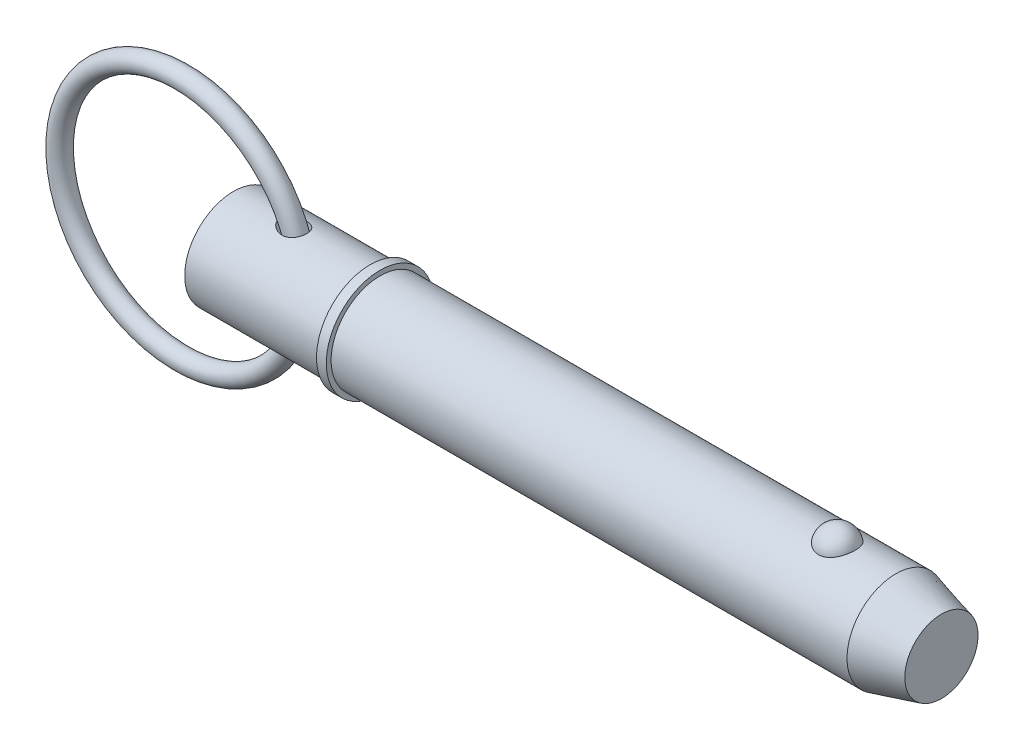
ISO-10303-21;
HEADER;
FILE_DESCRIPTION(('STEP AP214'),'2;1');
FILE_NAME('part.step','',(''),(''),'','','');
FILE_SCHEMA(('AUTOMOTIVE_DESIGN { 1 0 10303 214 1 1 1 1 }'));
ENDSEC;
DATA;
#1=APPLICATION_CONTEXT('core data for automotive mechanical design processes');
#2=APPLICATION_PROTOCOL_DEFINITION('international standard','automotive_design',2000,#1);
#3=PRODUCT_CONTEXT('',#1,'mechanical');
#4=PRODUCT('Part','Part','',(#3));
#5=PRODUCT_RELATED_PRODUCT_CATEGORY('part','',(#4));
#6=PRODUCT_DEFINITION_FORMATION('','',#4);
#7=PRODUCT_DEFINITION_CONTEXT('part definition',#1,'design');
#8=PRODUCT_DEFINITION('design','',#6,#7);
#9=PRODUCT_DEFINITION_SHAPE('','',#8);
#10=(LENGTH_UNIT() NAMED_UNIT(*) SI_UNIT(.MILLI.,.METRE.));
#11=(NAMED_UNIT(*) PLANE_ANGLE_UNIT() SI_UNIT($,.RADIAN.));
#12=(NAMED_UNIT(*) SI_UNIT($,.STERADIAN.) SOLID_ANGLE_UNIT());
#13=UNCERTAINTY_MEASURE_WITH_UNIT(LENGTH_MEASURE(1.E-05),#10,'distance_accuracy_value','');
#14=(GEOMETRIC_REPRESENTATION_CONTEXT(3) GLOBAL_UNCERTAINTY_ASSIGNED_CONTEXT((#13)) GLOBAL_UNIT_ASSIGNED_CONTEXT((#10,
#11,#12)) REPRESENTATION_CONTEXT('',''));
#15=CARTESIAN_POINT('',(0.,0.,0.));
#16=DIRECTION('',(0.,0.,1.));
#17=DIRECTION('',(1.,0.,0.));
#18=AXIS2_PLACEMENT_3D('',#15,#16,#17);
#19=CARTESIAN_POINT('',(-13.4840686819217,0.,0.));
#20=DIRECTION('',(0.,0.,1.));
#21=DIRECTION('',(1.,0.,0.));
#22=AXIS2_PLACEMENT_3D('',#19,#20,#21);
#23=TOROIDAL_SURFACE('',#22,31.75,2.54);
#24=CARTESIAN_POINT('',(20.8059313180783,0.,0.));
#25=VERTEX_POINT('',#24);
#26=VERTEX_LOOP('',#25);
#27=FACE_BOUND('',#26,.T.);
#28=ADVANCED_FACE('P0_F12',(#27),#23,.T.);
#29=CLOSED_SHELL('',(#28));
#30=MANIFOLD_SOLID_BREP('P0_B1',#29);
#31=CARTESIAN_POINT('',(0.,0.,0.));
#32=DIRECTION('',(1.,0.,0.));
#33=DIRECTION('',(0.,0.,-1.));
#34=AXIS2_PLACEMENT_3D('',#31,#32,#33);
#35=CYLINDRICAL_SURFACE('',#34,12.7);
#36=CARTESIAN_POINT('',(13.092900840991,12.5230976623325,-2.11234992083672));
#37=CARTESIAN_POINT('',(13.2535855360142,12.4976398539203,-2.26328363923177));
#38=CARTESIAN_POINT('',(13.4280602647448,12.4718592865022,-2.39955782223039));
#39=CARTESIAN_POINT('',(13.7976341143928,12.4229301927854,-2.64122157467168));
#40=CARTESIAN_POINT('',(13.9927568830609,12.3997847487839,-2.7465751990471));
#41=CARTESIAN_POINT('',(14.397672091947,12.3590534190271,-2.92439761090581));
#42=CARTESIAN_POINT('',(14.6074445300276,12.3414601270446,-2.99691026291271));
#43=CARTESIAN_POINT('',(15.0366557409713,12.3142893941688,-3.10669649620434));
#44=CARTESIAN_POINT('',(15.2560902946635,12.3047084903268,-3.14398530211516));
#45=CARTESIAN_POINT('',(15.5877843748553,12.2976819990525,-3.17128282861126));
#46=CARTESIAN_POINT('',(15.6989364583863,12.2965677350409,-3.17559470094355));
#47=CARTESIAN_POINT('',(15.9211629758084,12.2969101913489,-3.17427486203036));
#48=CARTESIAN_POINT('',(16.0322374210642,12.2983656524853,-3.16864802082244));
#49=CARTESIAN_POINT('',(16.2532861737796,12.3038832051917,-3.14715368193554));
#50=CARTESIAN_POINT('',(16.363260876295,12.3079443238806,-3.13129000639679));
#51=CARTESIAN_POINT('',(16.5810669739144,12.3185954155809,-3.08912320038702));
#52=CARTESIAN_POINT('',(16.6888986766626,12.3251850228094,-3.06282157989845));
#53=CARTESIAN_POINT('',(16.8894247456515,12.3398294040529,-3.00323791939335));
#54=CARTESIAN_POINT('',(16.9824664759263,12.3476389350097,-2.97106098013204));
#55=CARTESIAN_POINT('',(17.1651267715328,12.3648759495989,-2.89848824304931));
#56=CARTESIAN_POINT('',(17.2547457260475,12.3743032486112,-2.85809338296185));
#57=CARTESIAN_POINT('',(17.4297224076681,12.3944822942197,-2.76927391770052));
#58=CARTESIAN_POINT('',(17.5150817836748,12.40523352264,-2.72085245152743));
#59=CARTESIAN_POINT('',(17.6807665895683,12.4277046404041,-2.61629867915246));
#60=CARTESIAN_POINT('',(17.7610923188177,12.4394244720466,-2.56016683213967));
#61=CARTESIAN_POINT('',(17.9797287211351,12.4733252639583,-2.39133767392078));
#62=CARTESIAN_POINT('',(18.1114611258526,12.4961902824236,-2.27005507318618));
#63=CARTESIAN_POINT('',(18.3518677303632,12.5412050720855,-2.00648954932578));
#64=CARTESIAN_POINT('',(18.4605454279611,12.5633549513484,-1.86420981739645));
#65=CARTESIAN_POINT('',(18.6498843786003,12.6039384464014,-1.5661481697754));
#66=CARTESIAN_POINT('',(18.7311185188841,12.622444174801,-1.41073996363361));
#67=CARTESIAN_POINT('',(18.8669149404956,12.6543302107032,-1.08819514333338));
#68=CARTESIAN_POINT('',(18.921477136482,12.6677105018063,-0.921058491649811));
#69=CARTESIAN_POINT('',(19.0028875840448,12.6879542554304,-0.57902988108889));
#70=CARTESIAN_POINT('',(19.0296164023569,12.6947896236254,-0.40410783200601));
#71=CARTESIAN_POINT('',(19.0543673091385,12.7011128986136,-0.0521104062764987));
#72=CARTESIAN_POINT('',(19.0523885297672,12.7006005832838,0.124965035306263));
#73=CARTESIAN_POINT('',(19.019700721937,12.692266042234,0.476969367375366));
#74=CARTESIAN_POINT('',(18.9888798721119,12.6844153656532,0.651887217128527));
#75=CARTESIAN_POINT('',(18.8990221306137,12.6622099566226,0.99389064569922));
#76=CARTESIAN_POINT('',(18.839985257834,12.6478552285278,1.16097622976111));
#77=CARTESIAN_POINT('',(18.6951419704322,12.6142309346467,1.48231767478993));
#78=CARTESIAN_POINT('',(18.6093706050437,12.5949678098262,1.63659000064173));
#79=CARTESIAN_POINT('',(18.4131352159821,12.5536490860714,1.92810749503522));
#80=CARTESIAN_POINT('',(18.3026732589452,12.5315937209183,2.06535408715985));
#81=CARTESIAN_POINT('',(18.060669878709,12.4872833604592,2.31822774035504));
#82=CARTESIAN_POINT('',(17.9292520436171,12.4650302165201,2.43397343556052));
#83=CARTESIAN_POINT('',(17.6485957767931,12.4226514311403,2.64178289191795));
#84=CARTESIAN_POINT('',(17.4993587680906,12.4025256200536,2.73384854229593));
#85=CARTESIAN_POINT('',(17.1869531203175,12.3664726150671,2.8925825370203));
#86=CARTESIAN_POINT('',(17.0237450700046,12.3505578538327,2.95917592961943));
#87=CARTESIAN_POINT('',(16.6884731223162,12.3245177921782,3.06582547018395));
#88=CARTESIAN_POINT('',(16.516407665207,12.3143935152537,3.10587692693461));
#89=CARTESIAN_POINT('',(16.1604213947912,12.3003788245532,3.16093927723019));
#90=CARTESIAN_POINT('',(15.9763106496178,12.2967791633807,3.17478342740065));
#91=CARTESIAN_POINT('',(15.6080973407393,12.2966663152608,3.1752118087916));
#92=CARTESIAN_POINT('',(15.4239948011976,12.3001555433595,3.16178674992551));
#93=CARTESIAN_POINT('',(15.0417156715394,12.3141744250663,3.10676725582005));
#94=CARTESIAN_POINT('',(14.8439465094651,12.3253658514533,3.06251977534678));
#95=CARTESIAN_POINT('',(14.4574652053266,12.3538942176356,2.94531863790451));
#96=CARTESIAN_POINT('',(14.2687614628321,12.3712367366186,2.87233891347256));
#97=CARTESIAN_POINT('',(13.8856104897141,12.4121323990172,2.69045747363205));
#98=CARTESIAN_POINT('',(13.6926012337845,12.4361434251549,2.57861276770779));
#99=CARTESIAN_POINT('',(13.328588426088,12.4862632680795,2.32379935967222));
#100=CARTESIAN_POINT('',(13.1575718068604,12.5123708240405,2.18084927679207));
#101=CARTESIAN_POINT('',(12.8776146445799,12.5579467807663,1.89840233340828));
#102=CARTESIAN_POINT('',(12.7631663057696,12.5776642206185,1.76440341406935));
#103=CARTESIAN_POINT('',(12.5574911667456,12.6143643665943,1.47931295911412));
#104=CARTESIAN_POINT('',(12.4662309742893,12.6313509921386,1.32824646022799));
#105=CARTESIAN_POINT('',(12.3240650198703,12.6583901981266,1.03598403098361));
#106=CARTESIAN_POINT('',(12.2691183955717,12.6691064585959,0.89682285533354));
#107=CARTESIAN_POINT('',(12.1828741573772,12.6860954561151,0.611068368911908));
#108=CARTESIAN_POINT('',(12.1515620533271,12.6923709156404,0.464479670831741));
#109=CARTESIAN_POINT('',(12.1147168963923,12.6997676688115,0.167420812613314));
#110=CARTESIAN_POINT('',(12.109270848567,12.7008715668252,0.0169392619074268));
#111=CARTESIAN_POINT('',(12.1248234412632,12.6977391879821,-0.282592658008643));
#112=CARTESIAN_POINT('',(12.1458245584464,12.6935024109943,-0.431642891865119));
#113=CARTESIAN_POINT('',(12.210908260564,12.6805581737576,-0.716008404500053));
#114=CARTESIAN_POINT('',(12.2537133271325,12.6720986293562,-0.851633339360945));
#115=CARTESIAN_POINT('',(12.3591295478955,12.6516826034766,-1.11460776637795));
#116=CARTESIAN_POINT('',(12.4217455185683,12.6397252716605,-1.24195523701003));
#117=CARTESIAN_POINT('',(12.5735635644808,12.61152213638,-1.50300095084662));
#118=CARTESIAN_POINT('',(12.6652159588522,12.5949150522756,-1.63522875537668));
#119=CARTESIAN_POINT('',(12.8664347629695,12.5599626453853,-1.88501670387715));
#120=CARTESIAN_POINT('',(12.9760196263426,12.541615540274,-2.00256151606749));
#121=CARTESIAN_POINT('',(13.092900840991,12.5230976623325,-2.11234992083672));
#122=B_SPLINE_CURVE_WITH_KNOTS('',3,(#36,#37,#38,#39,#40,#41,#42,#43,#44,#45,#46,#47,#48,#49,
#50,#51,#52,#53,#54,#55,#56,#57,#58,#59,#60,#61,#62,#63,#64,#65,#66,#67,#68,#69,#70,#71,#72,#73,
#74,#75,#76,#77,#78,#79,#80,#81,#82,#83,#84,#85,#86,#87,#88,#89,#90,#91,#92,#93,#94,#95,#96,#97,
#98,#99,#100,#101,#102,#103,#104,#105,#106,#107,#108,#109,#110,#111,#112,#113,#114,#115,#116,
#117,#118,#119,#120,#121),.UNSPECIFIED.,.T.,.F.,(4,2,2,2,2,2,2,2,2,2,2,2,2,2,2,2,2,2,2,2,2,2,2,
2,2,2,2,2,2,2,2,2,2,2,2,2,2,2,2,2,2,2,4),(0.,0.665132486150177,1.33103515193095,
1.99604575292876,2.66076878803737,2.99410229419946,3.32727250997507,3.66031840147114,
3.99331613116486,4.28918991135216,4.58502994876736,4.88075456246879,5.17646157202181,
5.71510826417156,6.25367317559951,6.78017774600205,7.30668400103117,7.83544030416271,
8.36421259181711,8.89504347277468,9.42587399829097,9.95601150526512,10.4861046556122,
11.0131799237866,11.54021312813,12.0687854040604,12.597451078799,13.1491450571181,
13.7010270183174,14.3074556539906,14.914435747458,15.5844380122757,16.2540403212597,
16.7839879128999,17.3131679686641,17.7612578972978,18.2090728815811,18.658393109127,
19.1077554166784,19.5333866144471,19.959121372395,20.4424347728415,20.9262486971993),.UNSPECIFIED.);
#123=CARTESIAN_POINT('',(13.092900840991,12.5230976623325,-2.11234992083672));
#124=VERTEX_POINT('',#123);
#125=EDGE_CURVE('P1_E42',#124,#124,#122,.T.);
#126=ORIENTED_EDGE('',*,*,#125,.T.);
#127=EDGE_LOOP('',(#126));
#128=FACE_BOUND('',#127,.T.);
#129=CARTESIAN_POINT('',(0.,0.,0.));
#130=DIRECTION('',(1.,0.,0.));
#131=DIRECTION('',(0.,0.,-1.));
#132=AXIS2_PLACEMENT_3D('',#129,#130,#131);
#133=CIRCLE('',#132,12.7);
#134=CARTESIAN_POINT('',(0.,0.,-12.7));
#135=VERTEX_POINT('',#134);
#136=EDGE_CURVE('P1_E9',#135,#135,#133,.T.);
#137=ORIENTED_EDGE('',*,*,#136,.T.);
#138=EDGE_LOOP('',(#137));
#139=FACE_BOUND('',#138,.T.);
#140=CARTESIAN_POINT('',(35.56,0.,0.));
#141=DIRECTION('',(1.,0.,0.));
#142=DIRECTION('',(0.,0.,-1.));
#143=AXIS2_PLACEMENT_3D('',#140,#141,#142);
#144=CIRCLE('',#143,12.7);
#145=CARTESIAN_POINT('',(35.56,0.,-12.7));
#146=VERTEX_POINT('',#145);
#147=EDGE_CURVE('P1_E25',#146,#146,#144,.T.);
#148=ORIENTED_EDGE('',*,*,#147,.F.);
#149=EDGE_LOOP('',(#148));
#150=FACE_BOUND('',#149,.T.);
#151=CARTESIAN_POINT('',(13.092900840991,-12.5230976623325,-2.11234992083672));
#152=CARTESIAN_POINT('',(12.9659872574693,-12.5432050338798,-1.99314161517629));
#153=CARTESIAN_POINT('',(12.847667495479,-12.5631124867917,-1.86478966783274));
#154=CARTESIAN_POINT('',(12.6324721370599,-12.6007427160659,-1.59069749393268));
#155=CARTESIAN_POINT('',(12.5355833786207,-12.6184668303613,-1.444968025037));
#156=CARTESIAN_POINT('',(12.4099071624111,-12.642034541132,-1.21450950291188));
#157=CARTESIAN_POINT('',(12.3711427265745,-12.6494175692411,-1.13527163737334));
#158=CARTESIAN_POINT('',(12.3010994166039,-12.6628962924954,-0.973464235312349));
#159=CARTESIAN_POINT('',(12.2698164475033,-12.6689926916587,-0.890896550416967));
#160=CARTESIAN_POINT('',(12.2153933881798,-12.6796767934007,-0.72309085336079));
#161=CARTESIAN_POINT('',(12.192246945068,-12.6842656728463,-0.637854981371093));
#162=CARTESIAN_POINT('',(12.154603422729,-12.6917620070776,-0.465421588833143));
#163=CARTESIAN_POINT('',(12.1401047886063,-12.69466976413,-0.378224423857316));
#164=CARTESIAN_POINT('',(12.1214471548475,-12.6984180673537,-0.214417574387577));
#165=CARTESIAN_POINT('',(12.1161713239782,-12.699481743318,-0.13793855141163));
#166=CARTESIAN_POINT('',(12.1124989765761,-12.7002217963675,0.0152189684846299));
#167=CARTESIAN_POINT('',(12.1141046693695,-12.6998977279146,0.0918975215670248));
#168=CARTESIAN_POINT('',(12.1241695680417,-12.6978712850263,0.244746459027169));
#169=CARTESIAN_POINT('',(12.132625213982,-12.6961696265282,0.320917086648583));
#170=CARTESIAN_POINT('',(12.1562110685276,-12.6914452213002,0.472185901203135));
#171=CARTESIAN_POINT('',(12.1713438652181,-12.6884219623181,0.547283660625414));
#172=CARTESIAN_POINT('',(12.223731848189,-12.6780227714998,0.759415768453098));
#173=CARTESIAN_POINT('',(12.268839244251,-12.6691353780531,0.894507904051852));
#174=CARTESIAN_POINT('',(12.3786059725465,-12.6479567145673,1.1560647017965));
#175=CARTESIAN_POINT('',(12.4432700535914,-12.6356646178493,1.28252725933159));
#176=CARTESIAN_POINT('',(12.5971341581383,-12.607236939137,1.5381272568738));
#177=CARTESIAN_POINT('',(12.6882234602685,-12.5908303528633,1.66609325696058));
#178=CARTESIAN_POINT('',(12.887209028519,-12.5564642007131,1.90792082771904));
#179=CARTESIAN_POINT('',(12.995115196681,-12.5385037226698,2.02177401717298));
#180=CARTESIAN_POINT('',(13.2471335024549,-12.4987806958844,2.25547266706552));
#181=CARTESIAN_POINT('',(13.3941979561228,-12.4769622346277,2.3721269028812));
#182=CARTESIAN_POINT('',(13.7036983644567,-12.4349587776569,2.58329351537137));
#183=CARTESIAN_POINT('',(13.8661464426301,-12.4147750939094,2.67778822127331));
#184=CARTESIAN_POINT('',(14.2306024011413,-12.3748157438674,2.85722657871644));
#185=CARTESIAN_POINT('',(14.4347220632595,-12.3556533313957,2.93804226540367));
#186=CARTESIAN_POINT('',(14.8540416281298,-12.3245430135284,3.06594877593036));
#187=CARTESIAN_POINT('',(15.0692453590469,-12.3125976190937,3.11302786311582));
#188=CARTESIAN_POINT('',(15.3981213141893,-12.3014943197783,3.15648626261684));
#189=CARTESIAN_POINT('',(15.5100235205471,-12.298940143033,3.16639841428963));
#190=CARTESIAN_POINT('',(15.7342812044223,-12.2963942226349,3.17627668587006));
#191=CARTESIAN_POINT('',(15.8466364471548,-12.2964012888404,3.17624742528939));
#192=CARTESIAN_POINT('',(16.0707903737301,-12.2990694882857,3.16589868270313));
#193=CARTESIAN_POINT('',(16.1825892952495,-12.3017293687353,3.1555840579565));
#194=CARTESIAN_POINT('',(16.4046123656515,-12.3096862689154,3.12440163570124));
#195=CARTESIAN_POINT('',(16.514836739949,-12.314982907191,3.10353536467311));
#196=CARTESIAN_POINT('',(16.7211934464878,-12.3273933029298,3.05384263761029));
#197=CARTESIAN_POINT('',(16.8175961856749,-12.3342598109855,3.0260738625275));
#198=CARTESIAN_POINT('',(17.0073515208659,-12.3498131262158,2.96195947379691));
#199=CARTESIAN_POINT('',(17.100704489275,-12.3584997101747,2.92561491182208));
#200=CARTESIAN_POINT('',(17.2834584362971,-12.3774243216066,2.84448580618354));
#201=CARTESIAN_POINT('',(17.3728610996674,-12.3876616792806,2.79970490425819));
#202=CARTESIAN_POINT('',(17.5469061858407,-12.409352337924,2.701939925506));
#203=CARTESIAN_POINT('',(17.6315489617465,-12.4208055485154,2.64895645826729));
#204=CARTESIAN_POINT('',(17.7872886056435,-12.4433734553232,2.54070972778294));
#205=CARTESIAN_POINT('',(17.8589017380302,-12.4544123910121,2.4861716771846));
#206=CARTESIAN_POINT('',(17.9970802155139,-12.4768404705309,2.37105291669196));
#207=CARTESIAN_POINT('',(18.063643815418,-12.4882297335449,2.31047013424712));
#208=CARTESIAN_POINT('',(18.1911677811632,-12.5110137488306,2.18372894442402));
#209=CARTESIAN_POINT('',(18.2521311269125,-12.5224084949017,2.11757353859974));
#210=CARTESIAN_POINT('',(18.3680676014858,-12.5448751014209,1.98014449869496));
#211=CARTESIAN_POINT('',(18.4230385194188,-12.5559468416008,1.90886899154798));
#212=CARTESIAN_POINT('',(18.5752306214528,-12.5875288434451,1.6925769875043));
#213=CARTESIAN_POINT('',(18.6637018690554,-12.6071482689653,1.54111740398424));
#214=CARTESIAN_POINT('',(18.8143485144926,-12.6417556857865,1.225260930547));
#215=CARTESIAN_POINT('',(18.876524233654,-12.6567437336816,1.06086419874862));
#216=CARTESIAN_POINT('',(18.9733884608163,-12.6805238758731,0.723195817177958));
#217=CARTESIAN_POINT('',(19.0079967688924,-12.6892978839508,0.549899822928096));
#218=CARTESIAN_POINT('',(19.0486500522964,-12.6996362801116,0.199781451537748));
#219=CARTESIAN_POINT('',(19.054694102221,-12.7012004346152,0.0229589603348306));
#220=CARTESIAN_POINT('',(19.0380549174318,-12.6969431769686,-0.330044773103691));
#221=CARTESIAN_POINT('',(19.0152419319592,-12.6910884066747,-0.506219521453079));
#222=CARTESIAN_POINT('',(18.9411599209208,-12.672565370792,-0.852112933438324));
#223=CARTESIAN_POINT('',(18.8898907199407,-12.659897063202,-1.0218315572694));
#224=CARTESIAN_POINT('',(18.7600888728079,-12.6291327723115,-1.34987035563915));
#225=CARTESIAN_POINT('',(18.6815715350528,-12.6110398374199,-1.50819687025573));
#226=CARTESIAN_POINT('',(18.4991526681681,-12.5714188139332,-1.808997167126));
#227=CARTESIAN_POINT('',(18.3952529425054,-12.5498909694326,-1.95147207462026));
#228=CARTESIAN_POINT('',(18.1653806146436,-12.5059234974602,-2.21580059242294));
#229=CARTESIAN_POINT('',(18.0395297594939,-12.4834893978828,-2.33776101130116));
#230=CARTESIAN_POINT('',(17.7688701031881,-12.4400863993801,-2.55870399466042));
#231=CARTESIAN_POINT('',(17.624063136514,-12.4191173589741,-2.65768878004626));
#232=CARTESIAN_POINT('',(17.3196803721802,-12.380896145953,-2.8304192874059));
#233=CARTESIAN_POINT('',(17.1601036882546,-12.3636441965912,-2.90416349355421));
#234=CARTESIAN_POINT('',(16.8308162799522,-12.3345597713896,-3.02531546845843));
#235=CARTESIAN_POINT('',(16.6611041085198,-12.322728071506,-3.07271946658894));
#236=CARTESIAN_POINT('',(16.3099674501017,-12.3051318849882,-3.14246490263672));
#237=CARTESIAN_POINT('',(16.1283412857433,-12.2996014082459,-3.16384159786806));
#238=CARTESIAN_POINT('',(15.7639014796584,-12.2955807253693,-3.17942379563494));
#239=CARTESIAN_POINT('',(15.5810875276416,-12.2970924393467,-3.17362188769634));
#240=CARTESIAN_POINT('',(15.20154276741,-12.307074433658,-3.13470416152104));
#241=CARTESIAN_POINT('',(15.0050835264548,-12.316173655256,-3.09911848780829));
#242=CARTESIAN_POINT('',(14.6197996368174,-12.3407987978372,-2.99954607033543));
#243=CARTESIAN_POINT('',(14.4309834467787,-12.3563316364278,-2.93552875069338));
#244=CARTESIAN_POINT('',(14.0353751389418,-12.3949378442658,-2.76840280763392));
#245=CARTESIAN_POINT('',(13.8306109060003,-12.4188242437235,-2.66064798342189));
#246=CARTESIAN_POINT('',(13.4432099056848,-12.4696241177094,-2.4113475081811));
#247=CARTESIAN_POINT('',(13.2605568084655,-12.4965353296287,-2.26982702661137));
#248=CARTESIAN_POINT('',(13.092900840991,-12.5230976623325,-2.11234992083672));
#249=B_SPLINE_CURVE_WITH_KNOTS('',3,(#151,#152,#153,#154,#155,#156,#157,#158,#159,#160,#161,
#162,#163,#164,#165,#166,#167,#168,#169,#170,#171,#172,#173,#174,#175,#176,#177,#178,#179,#180,
#181,#182,#183,#184,#185,#186,#187,#188,#189,#190,#191,#192,#193,#194,#195,#196,#197,#198,#199,
#200,#201,#202,#203,#204,#205,#206,#207,#208,#209,#210,#211,#212,#213,#214,#215,#216,#217,#218,
#219,#220,#221,#222,#223,#224,#225,#226,#227,#228,#229,#230,#231,#232,#233,#234,#235,#236,#237,
#238,#239,#240,#241,#242,#243,#244,#245,#246,#247,#248),.UNSPECIFIED.,.T.,.F.,(4,2,2,2,2,2,2,2,
2,2,2,2,2,2,2,2,2,2,2,2,2,2,2,2,2,2,2,2,2,2,2,2,2,2,2,2,2,2,2,2,2,2,2,2,2,2,2,2,4),(0.,
0.525289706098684,1.05025590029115,1.31549608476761,1.58059075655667,1.84547798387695,
2.11031756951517,2.34000998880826,2.56977615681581,2.79942299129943,3.0291589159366,
3.45531787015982,3.8815803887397,4.35362362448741,4.82594586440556,5.39074449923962,
5.95599200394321,6.61421946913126,7.27267581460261,7.60939383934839,7.94595540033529,
8.2823580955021,8.61871213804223,8.91997243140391,9.22119579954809,9.52228943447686,
9.82336070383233,10.0950952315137,10.3669232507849,10.6386057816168,10.9103882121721,
11.4371688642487,11.9639430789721,12.4922442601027,13.0205625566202,13.5512648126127,
14.0819703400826,14.6123781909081,15.1427483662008,15.6702654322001,16.1977314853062,
16.7252292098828,17.2528024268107,17.7993878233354,18.3461222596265,18.9432829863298,
19.5410874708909,20.2355241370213,20.9294447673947),.UNSPECIFIED.);
#250=CARTESIAN_POINT('',(13.092900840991,-12.5230976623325,-2.11234992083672));
#251=VERTEX_POINT('',#250);
#252=EDGE_CURVE('P1_E17',#251,#251,#249,.T.);
#253=ORIENTED_EDGE('',*,*,#252,.T.);
#254=EDGE_LOOP('',(#253));
#255=FACE_BOUND('',#254,.T.);
#256=ADVANCED_FACE('P1_F13',(#128,#139,#150,#255),#35,.T.);
#257=CARTESIAN_POINT('',(0.,0.,0.));
#258=DIRECTION('',(1.,0.,0.));
#259=DIRECTION('',(0.,0.,-1.));
#260=AXIS2_PLACEMENT_3D('',#257,#258,#259);
#261=CYLINDRICAL_SURFACE('',#260,12.7);
#262=CARTESIAN_POINT('',(172.300738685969,0.,0.));
#263=DIRECTION('',(1.,0.,0.));
#264=DIRECTION('',(0.,0.,-1.));
#265=AXIS2_PLACEMENT_3D('',#262,#263,#264);
#266=CIRCLE('',#265,12.7);
#267=CARTESIAN_POINT('',(172.300738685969,0.,-12.7));
#268=VERTEX_POINT('',#267);
#269=EDGE_CURVE('P1_E99',#268,#268,#266,.T.);
#270=ORIENTED_EDGE('',*,*,#269,.F.);
#271=EDGE_LOOP('',(#270));
#272=FACE_BOUND('',#271,.T.);
#273=CARTESIAN_POINT('',(38.1,0.,0.));
#274=DIRECTION('',(1.,0.,0.));
#275=DIRECTION('',(0.,0.,-1.));
#276=AXIS2_PLACEMENT_3D('',#273,#274,#275);
#277=CIRCLE('',#276,12.7);
#278=CARTESIAN_POINT('',(38.1,0.,-12.7));
#279=VERTEX_POINT('',#278);
#280=EDGE_CURVE('P1_E96',#279,#279,#277,.T.);
#281=ORIENTED_EDGE('',*,*,#280,.T.);
#282=EDGE_LOOP('',(#281));
#283=FACE_BOUND('',#282,.T.);
#284=CARTESIAN_POINT('',(157.060042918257,11.7500437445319,4.81938502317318));
#285=CARTESIAN_POINT('',(156.935088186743,11.7500430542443,4.81938571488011));
#286=CARTESIAN_POINT('',(156.810144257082,11.7520975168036,4.81438658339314));
#287=CARTESIAN_POINT('',(156.561142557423,11.760253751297,4.79442904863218));
#288=CARTESIAN_POINT('',(156.437085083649,11.7663568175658,4.77946746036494));
#289=CARTESIAN_POINT('',(156.190901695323,11.7824262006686,4.7397141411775));
#290=CARTESIAN_POINT('',(156.068774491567,11.7923898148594,4.71492928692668));
#291=CARTESIAN_POINT('',(155.827187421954,11.8158938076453,4.65571340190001));
#292=CARTESIAN_POINT('',(155.70772859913,11.8294355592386,4.6212786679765));
#293=CARTESIAN_POINT('',(155.472557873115,11.8596812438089,4.54309502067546));
#294=CARTESIAN_POINT('',(155.356839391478,11.8763792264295,4.49936361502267));
#295=CARTESIAN_POINT('',(155.129653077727,11.9124878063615,4.40287235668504));
#296=CARTESIAN_POINT('',(155.018186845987,11.9318994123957,4.35010914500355));
#297=CARTESIAN_POINT('',(154.691278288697,11.9934256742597,4.17881316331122));
#298=CARTESIAN_POINT('',(154.483127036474,12.038858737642,4.04720756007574));
#299=CARTESIAN_POINT('',(154.085850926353,12.1352173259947,3.748564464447));
#300=CARTESIAN_POINT('',(153.897443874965,12.1862630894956,3.58061821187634));
#301=CARTESIAN_POINT('',(153.550521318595,12.2875163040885,3.21600758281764));
#302=CARTESIAN_POINT('',(153.392011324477,12.3377235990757,3.01933792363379));
#303=CARTESIAN_POINT('',(153.10168878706,12.4344923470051,2.592916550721));
#304=CARTESIAN_POINT('',(152.971376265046,12.4807925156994,2.36208286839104));
#305=CARTESIAN_POINT('',(152.749407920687,12.5623454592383,1.88070399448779));
#306=CARTESIAN_POINT('',(152.657755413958,12.5975972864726,1.63015711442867));
#307=CARTESIAN_POINT('',(152.514046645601,12.6538414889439,1.1129886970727));
#308=CARTESIAN_POINT('',(152.462499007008,12.6746503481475,0.846205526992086));
#309=CARTESIAN_POINT('',(152.401977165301,12.699153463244,0.307085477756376));
#310=CARTESIAN_POINT('',(152.393001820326,12.7028481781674,0.0347487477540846));
#311=CARTESIAN_POINT('',(152.417731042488,12.6927785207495,-0.506073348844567));
#312=CARTESIAN_POINT('',(152.451189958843,12.6791146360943,-0.774571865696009));
#313=CARTESIAN_POINT('',(152.559687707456,12.635882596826,-1.30170246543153));
#314=CARTESIAN_POINT('',(152.63472729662,12.606314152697,-1.56033436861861));
#315=CARTESIAN_POINT('',(152.82500006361,12.5342328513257,-2.0608389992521));
#316=CARTESIAN_POINT('',(152.940287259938,12.4917026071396,-2.30268867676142));
#317=CARTESIAN_POINT('',(153.208704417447,12.3981123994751,-2.76259600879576));
#318=CARTESIAN_POINT('',(153.361837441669,12.3470517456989,-2.98065173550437));
#319=CARTESIAN_POINT('',(153.703507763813,12.2416045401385,-3.38786328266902));
#320=CARTESIAN_POINT('',(153.892201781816,12.1872040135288,-3.57688418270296));
#321=CARTESIAN_POINT('',(154.300239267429,12.0814086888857,-3.91941073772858));
#322=CARTESIAN_POINT('',(154.519580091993,12.0300136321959,-4.07291945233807));
#323=CARTESIAN_POINT('',(154.978375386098,11.9373542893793,-4.33691289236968));
#324=CARTESIAN_POINT('',(155.217304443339,11.8958982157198,-4.44824125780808));
#325=CARTESIAN_POINT('',(155.71243761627,11.8268116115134,-4.62881985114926));
#326=CARTESIAN_POINT('',(155.968635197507,11.7991758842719,-4.69808589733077));
#327=CARTESIAN_POINT('',(156.477164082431,11.7622209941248,-4.78983181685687));
#328=CARTESIAN_POINT('',(156.729041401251,11.7520502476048,-4.81449025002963));
#329=CARTESIAN_POINT('',(157.233573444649,11.7485796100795,-4.82295735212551));
#330=CARTESIAN_POINT('',(157.486228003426,11.7552763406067,-4.80677420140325));
#331=CARTESIAN_POINT('',(157.976834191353,11.7842584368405,-4.73525430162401));
#332=CARTESIAN_POINT('',(158.214998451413,11.8060486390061,-4.68116061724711));
#333=CARTESIAN_POINT('',(158.678489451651,11.8622750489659,-4.53678133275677));
#334=CARTESIAN_POINT('',(158.903815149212,11.8967122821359,-4.44649279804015));
#335=CARTESIAN_POINT('',(159.340801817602,11.9754603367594,-4.2298761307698));
#336=CARTESIAN_POINT('',(159.552057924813,12.0199699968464,-4.10280539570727));
#337=CARTESIAN_POINT('',(159.950601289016,12.1138028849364,-3.81685409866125));
#338=CARTESIAN_POINT('',(160.137883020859,12.163127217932,-3.65796622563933));
#339=CARTESIAN_POINT('',(160.493350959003,12.2642343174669,-3.30364864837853));
#340=CARTESIAN_POINT('',(160.660111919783,12.3160165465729,-3.10678783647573));
#341=CARTESIAN_POINT('',(160.959579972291,12.4142566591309,-2.68748409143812));
#342=CARTESIAN_POINT('',(161.092280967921,12.4607135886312,-2.4650365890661));
#343=CARTESIAN_POINT('',(161.324691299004,12.5450236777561,-1.9928951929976));
#344=CARTESIAN_POINT('',(161.423215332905,12.5825557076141,-1.74255918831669));
#345=CARTESIAN_POINT('',(161.579227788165,12.6431720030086,-1.2277373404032));
#346=CARTESIAN_POINT('',(161.636715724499,12.6662560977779,-0.96325132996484));
#347=CARTESIAN_POINT('',(161.709544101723,12.6956486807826,-0.427355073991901));
#348=CARTESIAN_POINT('',(161.724837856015,12.7019385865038,-0.155937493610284));
#349=CARTESIAN_POINT('',(161.712779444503,12.6970201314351,0.385928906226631));
#350=CARTESIAN_POINT('',(161.68542805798,12.6858120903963,0.65637774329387));
#351=CARTESIAN_POINT('',(161.613060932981,12.6568455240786,1.05454017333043));
#352=CARTESIAN_POINT('',(161.583796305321,12.6451962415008,1.185778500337));
#353=CARTESIAN_POINT('',(161.515022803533,12.6181819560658,1.44513808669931));
#354=CARTESIAN_POINT('',(161.475517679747,12.6028183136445,1.57326046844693));
#355=CARTESIAN_POINT('',(161.386439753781,12.5687547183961,1.82554978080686));
#356=CARTESIAN_POINT('',(161.336862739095,12.5500533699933,1.9497150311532));
#357=CARTESIAN_POINT('',(161.22792115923,12.5098093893,2.1931437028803));
#358=CARTESIAN_POINT('',(161.168560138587,12.4882677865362,2.31240887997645));
#359=CARTESIAN_POINT('',(161.03997128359,12.4427679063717,2.5459303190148));
#360=CARTESIAN_POINT('',(160.970688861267,12.4187964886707,2.66015396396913));
#361=CARTESIAN_POINT('',(160.822903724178,12.3691892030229,2.88202659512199));
#362=CARTESIAN_POINT('',(160.744404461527,12.3435539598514,2.98967802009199));
#363=CARTESIAN_POINT('',(160.578550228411,12.2912955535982,3.1977438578));
#364=CARTESIAN_POINT('',(160.491191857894,12.2646720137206,3.29815546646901));
#365=CARTESIAN_POINT('',(160.308161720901,12.2111945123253,3.49095035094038));
#366=CARTESIAN_POINT('',(160.212493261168,12.1843406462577,3.58333679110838));
#367=CARTESIAN_POINT('',(160.013627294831,12.1312249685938,3.75922876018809));
#368=CARTESIAN_POINT('',(159.910450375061,12.104961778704,3.84275713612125));
#369=CARTESIAN_POINT('',(159.69701336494,12.0537284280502,4.00056406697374));
#370=CARTESIAN_POINT('',(159.586756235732,12.028757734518,4.07484645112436));
#371=CARTESIAN_POINT('',(159.359755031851,11.9808306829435,4.21367959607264));
#372=CARTESIAN_POINT('',(159.243006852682,11.9578756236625,4.27822410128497));
#373=CARTESIAN_POINT('',(159.00394258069,11.9147184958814,4.39698483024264));
#374=CARTESIAN_POINT('',(158.881628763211,11.894515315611,4.45120522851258));
#375=CARTESIAN_POINT('',(158.622952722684,11.8561129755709,4.55255353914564));
#376=CARTESIAN_POINT('',(158.486223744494,11.8381764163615,4.59884858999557));
#377=CARTESIAN_POINT('',(158.208608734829,11.8069093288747,4.67853897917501));
#378=CARTESIAN_POINT('',(158.067724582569,11.7935767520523,4.71194005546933));
#379=CARTESIAN_POINT('',(157.78309446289,11.7720277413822,4.76552188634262));
#380=CARTESIAN_POINT('',(157.639348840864,11.7638106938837,4.78570422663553));
#381=CARTESIAN_POINT('',(157.350411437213,11.7528195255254,4.81263433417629));
#382=CARTESIAN_POINT('',(157.205219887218,11.7500445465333,4.81938421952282));
#383=CARTESIAN_POINT('',(157.060042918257,11.7500437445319,4.81938502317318));
#384=B_SPLINE_CURVE_WITH_KNOTS('',3,(#284,#285,#286,#287,#288,#289,#290,#291,#292,#293,#294,
#295,#296,#297,#298,#299,#300,#301,#302,#303,#304,#305,#306,#307,#308,#309,#310,#311,#312,#313,
#314,#315,#316,#317,#318,#319,#320,#321,#322,#323,#324,#325,#326,#327,#328,#329,#330,#331,#332,
#333,#334,#335,#336,#337,#338,#339,#340,#341,#342,#343,#344,#345,#346,#347,#348,#349,#350,#351,
#352,#353,#354,#355,#356,#357,#358,#359,#360,#361,#362,#363,#364,#365,#366,#367,#368,#369,#370,
#371,#372,#373,#374,#375,#376,#377,#378,#379,#380,#381,#382,#383),.UNSPECIFIED.,.T.,.F.,(4,2,2,
2,2,2,2,2,2,2,2,2,2,2,2,2,2,2,2,2,2,2,2,2,2,2,2,2,2,2,2,2,2,2,2,2,2,2,2,2,2,2,2,2,2,2,2,2,2,4),
(0.,0.374729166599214,0.749578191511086,1.12416526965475,1.49889629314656,1.87292776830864,
2.24709865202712,2.99481328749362,3.76399449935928,4.53331735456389,5.3368391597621,
6.14042986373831,6.95405296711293,7.76765424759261,8.57656703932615,9.38549455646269,
10.1955119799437,11.0055949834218,11.8193353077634,12.6330054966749,13.4294141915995,
14.2255231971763,14.9815786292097,15.7374826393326,16.4696948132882,17.2019663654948,
17.9501979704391,18.6986017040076,19.484470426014,20.2704797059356,21.0815215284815,
21.8925729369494,22.7045213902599,23.5164550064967,23.9209608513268,24.3253187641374,
24.7298461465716,25.1342272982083,25.54092555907,25.9474719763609,26.3541750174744,
26.7607169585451,27.1661834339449,27.5714814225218,27.9770386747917,28.3824315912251,
28.818120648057,29.2536155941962,29.6890582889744,30.1244323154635),.UNSPECIFIED.);
#385=CARTESIAN_POINT('',(157.060042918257,11.7500437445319,4.81938502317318));
#386=VERTEX_POINT('',#385);
#387=EDGE_CURVE('P1_E34',#386,#386,#384,.T.);
#388=ORIENTED_EDGE('',*,*,#387,.T.);
#389=EDGE_LOOP('',(#388));
#390=FACE_BOUND('',#389,.T.);
#391=ADVANCED_FACE('P1_F46',(#272,#283,#390),#261,.T.);
#392=CARTESIAN_POINT('',(0.,0.,0.));
#393=DIRECTION('',(-1.,0.,0.));
#394=DIRECTION('',(0.,0.,1.));
#395=AXIS2_PLACEMENT_3D('',#392,#393,#394);
#396=PLANE('',#395);
#397=ORIENTED_EDGE('',*,*,#136,.F.);
#398=EDGE_LOOP('',(#397));
#399=FACE_BOUND('',#398,.T.);
#400=ADVANCED_FACE('P1_F15',(#399),#396,.T.);
#401=CARTESIAN_POINT('',(35.56,12.7,0.));
#402=DIRECTION('',(-1.,0.,0.));
#403=DIRECTION('',(0.,0.,1.));
#404=AXIS2_PLACEMENT_3D('',#401,#402,#403);
#405=PLANE('',#404);
#406=ORIENTED_EDGE('',*,*,#147,.T.);
#407=EDGE_LOOP('',(#406));
#408=FACE_BOUND('',#407,.T.);
#409=CARTESIAN_POINT('',(35.56,0.,0.));
#410=DIRECTION('',(1.,0.,0.));
#411=DIRECTION('',(0.,0.,-1.));
#412=AXIS2_PLACEMENT_3D('',#409,#410,#411);
#413=CIRCLE('',#412,13.97);
#414=CARTESIAN_POINT('',(35.56,0.,-13.97));
#415=VERTEX_POINT('',#414);
#416=EDGE_CURVE('P1_E30',#415,#415,#413,.T.);
#417=ORIENTED_EDGE('',*,*,#416,.F.);
#418=EDGE_LOOP('',(#417));
#419=FACE_BOUND('',#418,.T.);
#420=ADVANCED_FACE('P1_F81',(#408,#419),#405,.T.);
#421=CARTESIAN_POINT('',(0.,0.,0.));
#422=DIRECTION('',(1.,0.,0.));
#423=DIRECTION('',(0.,0.,-1.));
#424=AXIS2_PLACEMENT_3D('',#421,#422,#423);
#425=CYLINDRICAL_SURFACE('',#424,13.97);
#426=ORIENTED_EDGE('',*,*,#416,.T.);
#427=EDGE_LOOP('',(#426));
#428=FACE_BOUND('',#427,.T.);
#429=CARTESIAN_POINT('',(38.1,0.,0.));
#430=DIRECTION('',(1.,0.,0.));
#431=DIRECTION('',(0.,0.,-1.));
#432=AXIS2_PLACEMENT_3D('',#429,#430,#431);
#433=CIRCLE('',#432,13.97);
#434=CARTESIAN_POINT('',(38.1,0.,-13.97));
#435=VERTEX_POINT('',#434);
#436=EDGE_CURVE('P1_E95',#435,#435,#433,.T.);
#437=ORIENTED_EDGE('',*,*,#436,.F.);
#438=EDGE_LOOP('',(#437));
#439=FACE_BOUND('',#438,.T.);
#440=ADVANCED_FACE('P1_F68',(#428,#439),#425,.T.);
#441=CARTESIAN_POINT('',(38.1,13.97,0.));
#442=DIRECTION('',(1.,0.,0.));
#443=DIRECTION('',(0.,0.,-1.));
#444=AXIS2_PLACEMENT_3D('',#441,#442,#443);
#445=PLANE('',#444);
#446=ORIENTED_EDGE('',*,*,#436,.T.);
#447=EDGE_LOOP('',(#446));
#448=FACE_BOUND('',#447,.T.);
#449=ORIENTED_EDGE('',*,*,#280,.F.);
#450=EDGE_LOOP('',(#449));
#451=FACE_BOUND('',#450,.T.);
#452=ADVANCED_FACE('P1_F62',(#448,#451),#445,.T.);
#453=CARTESIAN_POINT('',(184.15,0.,0.));
#454=DIRECTION('',(-1.,0.,0.));
#455=DIRECTION('',(0.,0.,1.));
#456=AXIS2_PLACEMENT_3D('',#453,#454,#455);
#457=CONICAL_SURFACE('',#456,9.52500000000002,0.261799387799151);
#458=ORIENTED_EDGE('',*,*,#269,.T.);
#459=EDGE_LOOP('',(#458));
#460=FACE_BOUND('',#459,.T.);
#461=CARTESIAN_POINT('',(184.15,0.,0.));
#462=DIRECTION('',(1.,0.,0.));
#463=DIRECTION('',(0.,0.,-1.));
#464=AXIS2_PLACEMENT_3D('',#461,#462,#463);
#465=CIRCLE('',#464,9.52500000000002);
#466=CARTESIAN_POINT('',(184.15,0.,-9.52500000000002));
#467=VERTEX_POINT('',#466);
#468=EDGE_CURVE('P1_E41',#467,#467,#465,.T.);
#469=ORIENTED_EDGE('',*,*,#468,.F.);
#470=EDGE_LOOP('',(#469));
#471=FACE_BOUND('',#470,.T.);
#472=ADVANCED_FACE('P1_F59',(#460,#471),#457,.T.);
#473=CARTESIAN_POINT('',(184.15,9.52500000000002,0.));
#474=DIRECTION('',(1.,0.,0.));
#475=DIRECTION('',(0.,0.,-1.));
#476=AXIS2_PLACEMENT_3D('',#473,#474,#475);
#477=PLANE('',#476);
#478=ORIENTED_EDGE('',*,*,#468,.T.);
#479=EDGE_LOOP('',(#478));
#480=FACE_BOUND('',#479,.T.);
#481=ADVANCED_FACE('P1_F55',(#480),#477,.T.);
#482=CARTESIAN_POINT('',(157.060042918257,11.43,0.));
#483=DIRECTION('',(-1.,0.,0.));
#484=DIRECTION('',(0.,1.,0.));
#485=AXIS2_PLACEMENT_3D('',#482,#483,#484);
#486=SPHERICAL_SURFACE('',#485,4.83);
#487=ORIENTED_EDGE('',*,*,#387,.F.);
#488=EDGE_LOOP('',(#487));
#489=FACE_BOUND('',#488,.T.);
#490=ADVANCED_FACE('P1_F50',(#489),#486,.T.);
#491=CARTESIAN_POINT('',(-13.4840686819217,0.,0.));
#492=DIRECTION('',(0.,0.,1.));
#493=DIRECTION('',(1.,0.,0.));
#494=AXIS2_PLACEMENT_3D('',#491,#492,#493);
#495=TOROIDAL_SURFACE('',#494,31.75,3.175);
#496=ORIENTED_EDGE('',*,*,#252,.F.);
#497=EDGE_LOOP('',(#496));
#498=FACE_BOUND('',#497,.T.);
#499=ORIENTED_EDGE('',*,*,#125,.F.);
#500=EDGE_LOOP('',(#499));
#501=FACE_BOUND('',#500,.T.);
#502=ADVANCED_FACE('P1_F54',(#498,#501),#495,.F.);
#503=CLOSED_SHELL('',(#256,#391,#400,#420,#440,#452,#472,#481,#490,#502));
#504=MANIFOLD_SOLID_BREP('P1_B1',#503);
#505=ADVANCED_BREP_SHAPE_REPRESENTATION('',(#18,#30,#504),#14);
#506=SHAPE_DEFINITION_REPRESENTATION(#9,#505);
ENDSEC;
END-ISO-10303-21;
